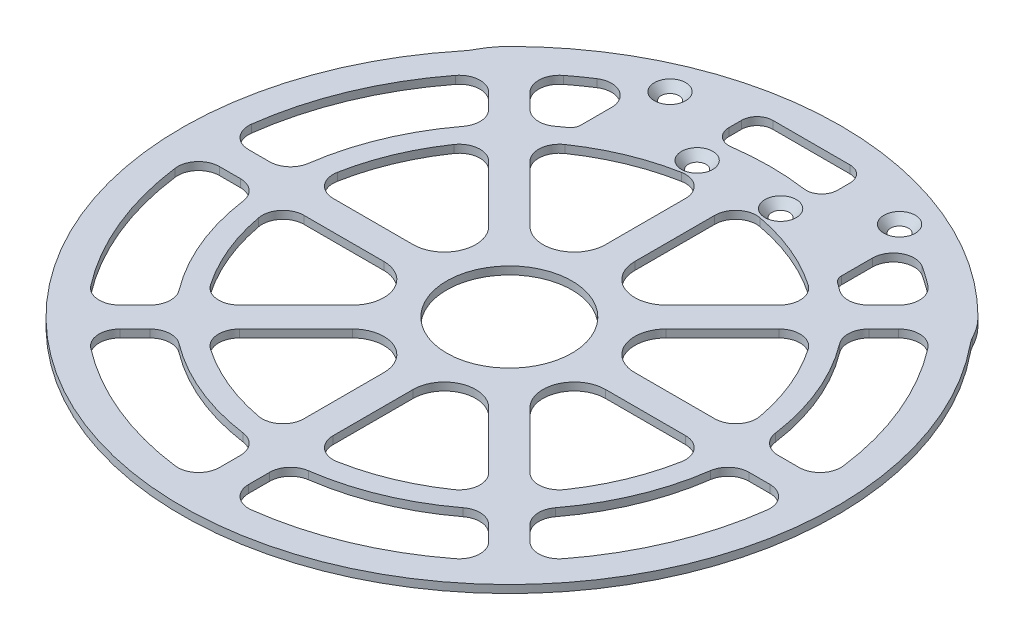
from build123d import *

# Parameters (mm, degrees)
SKETCH2_R                                     = 99.695
BOSS_EXTRUDE2_DEPTH                           = 2.38125
CUT_EXTRUDE3_DEPTH                            = 142.01012872
CIRPATTERN1_COUNT                             = 8
F_1_1_DIAMETER_HOLE1_D                        = 38.1
BOSS_EXTRUDE3_DEPTH                           = 2.38125
CUT_EXTRUDE5_DEPTH                            = 2.38125
CSK_FOR_8_FLAT_HEAD_MACHINE_SCREW1_AT_2_COUNT = 2
CSK_FOR_8_FLAT_HEAD_MACHINE_SCREW1_AT_2_PITCH = 69.850000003
CSK_FOR_8_FLAT_HEAD_MACHINE_SCREW1_AT_3_COUNT = 2
CSK_FOR_8_FLAT_HEAD_MACHINE_SCREW1_AT_3_PITCH = 49.631658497
CSK_FOR_8_FLAT_HEAD_MACHINE_SCREW1_AT_4_COUNT = 2
CSK_FOR_8_FLAT_HEAD_MACHINE_SCREW1_AT_4_PITCH = 26.250933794
FILLET2_R                                     = 3.175
FILLET3_R                                     = 6.35
BOSS_EXTRUDE4_START                           = -2.38125
BOSS_EXTRUDE4_DEPTH                           = 2.38125
FILLET4_R                                     = 12.7


with BuildPart() as part:
    # Sketch2 → Boss-Extrude2 (new body)
    with BuildSketch(Plane(origin=(0, 0, 0), x_dir=(-1, 0, 0), z_dir=(0, -1, 0))):
        with Locations(Location((0, 0, 0), (0, 0, 90))):
            Circle(SKETCH2_R)
    extrude(amount=-BOSS_EXTRUDE2_DEPTH)

    # Sketch5 → Cut-Extrude3 (cut, through all)
    with BuildSketch(Plane(origin=(0, 0, 0), x_dir=(-1, 0, 0), z_dir=(0, 1, 0))):
        with BuildLine():
            Line((-33.726563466, -4.445), (-58.059977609, -4.445))
            ThreePointArc((-58.059977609, -4.445), (-62.943279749, -6.735953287), (-64.302985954, -11.955752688))
            ThreePointArc((-64.302985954, -11.955752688), (-60.426340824, -25.029409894), (-53.923071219, -37.015083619))
            ThreePointArc((-53.923071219, -37.015083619), (-49.270658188, -39.744581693), (-44.197693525, -37.911514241))
            Line((-44.197693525, -37.911514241), (-26.991371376, -20.705192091))
            ThreePointArc((-26.991371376, -20.705192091), (-24.926610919, -10.324940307), (-33.726563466, -4.445))
        make_face()
        with BuildLine():
            Line((-4.445, -58.059977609), (-4.445, -33.726563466))
            ThreePointArc((-4.445, -33.726563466), (-10.324940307, -24.926610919), (-20.705192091, -26.991371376))
            Line((-20.705192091, -26.991371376), (-37.911514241, -44.197693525))
            ThreePointArc((-37.911514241, -44.197693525), (-39.744581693, -49.270658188), (-37.015083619, -53.923071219))
            ThreePointArc((-37.015083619, -53.923071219), (-25.029409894, -60.426340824), (-11.955752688, -64.302985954))
            ThreePointArc((-11.955752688, -64.302985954), (-6.735953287, -62.943279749), (-4.445, -58.059977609))
        make_face()
        with BuildLine():
            Line((-56.085767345, -62.371946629), (-51.555443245, -57.841622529))
            ThreePointArc((-51.555443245, -57.841622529), (-47.505192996, -55.997004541), (-43.238866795, -57.264128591))
            ThreePointArc((-43.238866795, -57.264128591), (-27.459449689, -66.292975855), (-9.917357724, -71.066349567))
            ThreePointArc((-9.917357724, -71.066349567), (-6.004617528, -73.187105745), (-4.445, -77.355407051))
            Line((-4.445, -77.355407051), (-4.445, -83.762252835))
            ThreePointArc((-4.445, -83.762252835), (-6.601642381, -88.530717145), (-11.606654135, -90.060166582))
            ThreePointArc((-11.606654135, -90.060166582), (-34.749569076, -83.89288095), (-55.475010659, -71.889298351))
            ThreePointArc((-55.475010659, -71.889298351), (-57.932604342, -67.268736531), (-56.085767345, -62.371946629))
        make_face()
        with BuildLine():
            Line((-62.371946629, -56.085767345), (-57.841622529, -51.555443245))
            ThreePointArc((-57.841622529, -51.555443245), (-55.997004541, -47.505192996), (-57.264128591, -43.238866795))
            ThreePointArc((-57.264128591, -43.238866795), (-66.292975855, -27.459449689), (-71.066349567, -9.917357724))
            ThreePointArc((-71.066349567, -9.917357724), (-73.187105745, -6.004617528), (-77.355407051, -4.445))
            Line((-77.355407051, -4.445), (-83.762252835, -4.445))
            ThreePointArc((-83.762252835, -4.445), (-88.530717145, -6.601642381), (-90.060166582, -11.606654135))
            ThreePointArc((-90.060166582, -11.606654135), (-83.89288095, -34.749569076), (-71.889298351, -55.475010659))
            ThreePointArc((-71.889298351, -55.475010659), (-67.268736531, -57.932604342), (-62.371946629, -56.085767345))
        make_face()
    cut_extrude3 = extrude(amount=CUT_EXTRUDE3_DEPTH, mode=Mode.SUBTRACT)

    # CirPattern1: Cut-Extrude3 ×8 about axis
    cirpattern1_axis = Axis((0, 0, 0), (0, 1, 0))
    for i in range(1, CIRPATTERN1_COUNT):
        add(cut_extrude3.rotate(cirpattern1_axis, i * 360 / CIRPATTERN1_COUNT), mode=Mode.SUBTRACT)

    # 1 _1_ Diameter Hole1 (through all)
    with Locations(Plane(origin=(0, 2.38125, 0), x_dir=(1, 0, 0), z_dir=(0, 1, 0))):
        with Locations((0, 0)):
            Hole(F_1_1_DIAMETER_HOLE1_D / 2)

    # Sketch8 → Boss-Extrude3 (add)
    with BuildSketch(Plane.XZ):
        with BuildLine():
            Line((39.687499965, -81.672825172), (39.687499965, -59.780284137))
            ThreePointArc((39.687499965, -59.780284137), (0, -71.755), (-39.687499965, -59.780284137))
            Line((-39.687499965, -59.780284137), (-39.687499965, -81.672825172))
            ThreePointArc((-39.687499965, -81.672825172), (-28.087229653, -86.351928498), (-15.954000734, -89.392493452))
            ThreePointArc((-15.954000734, -89.392493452), (-14.201704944, -91.240844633), (-11.7475, -91.921888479))
            Line((-11.7475, -91.921888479), (11.7475, -91.921888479))
            ThreePointArc((11.7475, -91.921888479), (14.201704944, -91.240844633), (15.954000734, -89.392493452))
            ThreePointArc((15.954000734, -89.392493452), (28.087229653, -86.351928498), (39.687499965, -81.672825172))
        make_face()
    extrude(amount=-BOSS_EXTRUDE3_DEPTH)

    # Sketch9 → Cut-Extrude5 (cut)
    with BuildSketch(Plane.XZ):
        with BuildLine():
            Line((-16.51, -83.313355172), (-16.51, -87.159388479))
            ThreePointArc((-16.51, -87.159388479), (-15.115096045, -90.526984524), (-11.7475, -91.921888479))
            Line((-11.7475, -91.921888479), (11.7475, -91.921888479))
            ThreePointArc((11.7475, -91.921888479), (15.115096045, -90.526984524), (16.51, -87.159388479))
            Line((16.51, -87.159388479), (16.51, -83.313355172))
            ThreePointArc((16.51, -83.313355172), (14.871165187, -79.718341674), (11.08254717, -78.597504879))
            ThreePointArc((11.08254717, -78.597504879), (0, -79.375), (-11.08254717, -78.597504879))
            ThreePointArc((-11.08254717, -78.597504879), (-14.871165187, -79.718341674), (-16.51, -83.313355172))
        make_face()
    extrude(amount=-CUT_EXTRUDE5_DEPTH, mode=Mode.SUBTRACT)

    # Sketch4 → CSK for _8 Flat Head Machine Screw1 (revolve, cut)
    with BuildSketch(Plane(origin=(-34.925000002, 2.38125, -83.819999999), x_dir=(0, 0, 1), z_dir=(1, 0, 0))):
        Polygon((0, 0), (0, 2.38125), (2.45745, 2.38125), (2.45745, 2.658435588), (4.7683928, 0), align=None)
    csk_for_8_flat_head_machine_screw1 = revolve(axis=Axis((-34.925000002, 8.73125, -83.819999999), (0, -1, 0)), mode=Mode.SUBTRACT)

    # CSK for _8 Flat Head Machine Screw1 at 2: CSK for _8 Flat Head Machine Screw1 ×2
    with Locations(*[(i * CSK_FOR_8_FLAT_HEAD_MACHINE_SCREW1_AT_2_PITCH, 0, 0) for i in range(1, CSK_FOR_8_FLAT_HEAD_MACHINE_SCREW1_AT_2_COUNT)]):
        add(csk_for_8_flat_head_machine_screw1, mode=Mode.SUBTRACT)

    # CSK for _8 Flat Head Machine Screw1 at 3: CSK for _8 Flat Head Machine Screw1 ×2
    with Locations(*[Vector(0.9595689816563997, 0, 0.2814735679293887) * (i * CSK_FOR_8_FLAT_HEAD_MACHINE_SCREW1_AT_3_PITCH) for i in range(1, CSK_FOR_8_FLAT_HEAD_MACHINE_SCREW1_AT_3_COUNT)]):
        add(csk_for_8_flat_head_machine_screw1, mode=Mode.SUBTRACT)

    # CSK for _8 Flat Head Machine Screw1 at 4: CSK for _8 Flat Head Machine Screw1 ×2
    with Locations(*[Vector(0.8466365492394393, 0, 0.532171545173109) * (i * CSK_FOR_8_FLAT_HEAD_MACHINE_SCREW1_AT_4_PITCH) for i in range(1, CSK_FOR_8_FLAT_HEAD_MACHINE_SCREW1_AT_4_COUNT)]):
        add(csk_for_8_flat_head_machine_screw1, mode=Mode.SUBTRACT)

    # Fillet2
    fillet2_edges = [part.edges().sort_by_distance(p)[0] for p in [
        (-39.687499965, 1.190625, -59.780284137),
        (39.687499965, 1.190625, -59.780284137),
    ]]
    fillet(fillet2_edges, radius=FILLET2_R)

    # Fillet3
    fillet3_edges = [part.edges().sort_by_distance(p)[0] for p in [
        (39.687499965, 1.190625, -81.672825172),
        (-39.687499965, 1.190625, -81.672825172),
    ]]
    fillet(fillet3_edges, radius=FILLET3_R)

    # Sketch13 → Boss-Extrude4 (add)
    with BuildSketch(Plane(origin=(0, 2.38125, 0), x_dir=(1, 0, 0), z_dir=(0, 1, 0)).offset(BOSS_EXTRUDE4_START)):
        with BuildLine():
            ThreePointArc((71.303233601, 71.303233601), (0, 100.838), (-71.303233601, 71.303233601))
            ThreePointArc((-71.303233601, 71.303233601), (-74.138576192, 67.926699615), (-76.347292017, 64.110716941))
            ThreePointArc((-76.347292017, 64.110716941), (0, 99.695), (76.347292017, 64.110716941))
            ThreePointArc((76.347292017, 64.110716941), (74.138576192, 67.926699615), (71.303233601, 71.303233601))
        make_face()
    extrude(amount=BOSS_EXTRUDE4_DEPTH)

    # Fillet4
    fillet4_edges = [part.edges().sort_by_distance(p)[0] for p in [
        (-76.347292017, 1.190625, -64.110716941),
        (76.347292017, 1.190625, -64.110716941),
    ]]
    fillet(fillet4_edges, radius=FILLET4_R)


solid = part.part
